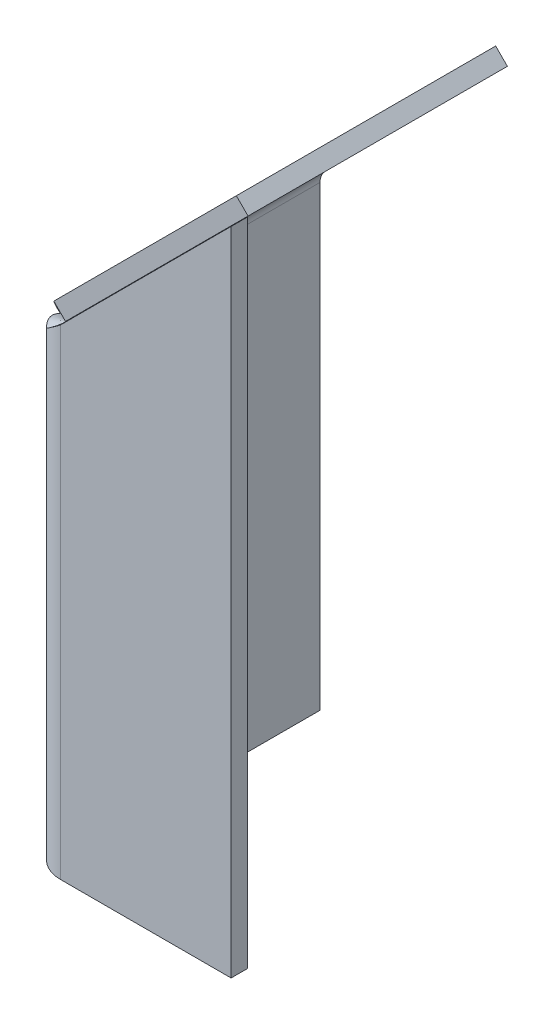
ISO-10303-21;
HEADER;
FILE_DESCRIPTION(('STEP AP214'),'2;1');
FILE_NAME('part.step','',(''),(''),'','','');
FILE_SCHEMA(('AUTOMOTIVE_DESIGN { 1 0 10303 214 1 1 1 1 }'));
ENDSEC;
DATA;
#1=APPLICATION_CONTEXT('core data for automotive mechanical design processes');
#2=APPLICATION_PROTOCOL_DEFINITION('international standard','automotive_design',2000,#1);
#3=PRODUCT_CONTEXT('',#1,'mechanical');
#4=PRODUCT('Part','Part','',(#3));
#5=PRODUCT_RELATED_PRODUCT_CATEGORY('part','',(#4));
#6=PRODUCT_DEFINITION_FORMATION('','',#4);
#7=PRODUCT_DEFINITION_CONTEXT('part definition',#1,'design');
#8=PRODUCT_DEFINITION('design','',#6,#7);
#9=PRODUCT_DEFINITION_SHAPE('','',#8);
#10=(LENGTH_UNIT() NAMED_UNIT(*) SI_UNIT(.MILLI.,.METRE.));
#11=(NAMED_UNIT(*) PLANE_ANGLE_UNIT() SI_UNIT($,.RADIAN.));
#12=(NAMED_UNIT(*) SI_UNIT($,.STERADIAN.) SOLID_ANGLE_UNIT());
#13=UNCERTAINTY_MEASURE_WITH_UNIT(LENGTH_MEASURE(1.E-05),#10,'distance_accuracy_value','');
#14=(GEOMETRIC_REPRESENTATION_CONTEXT(3) GLOBAL_UNCERTAINTY_ASSIGNED_CONTEXT((#13)) GLOBAL_UNIT_ASSIGNED_CONTEXT((#10,
#11,#12)) REPRESENTATION_CONTEXT('',''));
#15=CARTESIAN_POINT('',(0.,0.,0.));
#16=DIRECTION('',(0.,0.,1.));
#17=DIRECTION('',(1.,0.,0.));
#18=AXIS2_PLACEMENT_3D('',#15,#16,#17);
#19=CARTESIAN_POINT('',(0.,0.,49.9999999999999));
#20=DIRECTION('',(-1.,0.,0.));
#21=DIRECTION('',(0.,0.,1.));
#22=AXIS2_PLACEMENT_3D('',#19,#20,#21);
#23=PLANE('',#22);
#24=DIRECTION('',(0.,0.,-1.));
#25=VECTOR('',#24,1.);
#26=CARTESIAN_POINT('',(0.,0.,49.9999999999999));
#27=LINE('',#26,#25);
#28=CARTESIAN_POINT('',(0.,0.,44.));
#29=VERTEX_POINT('',#28);
#30=CARTESIAN_POINT('',(0.,0.,0.));
#31=VERTEX_POINT('',#30);
#32=EDGE_CURVE('E446',#29,#31,#27,.T.);
#33=ORIENTED_EDGE('',*,*,#32,.F.);
#34=DIRECTION('',(0.,1.,0.));
#35=VECTOR('',#34,1.);
#36=CARTESIAN_POINT('',(0.,0.,44.));
#37=LINE('',#36,#35);
#38=CARTESIAN_POINT('',(0.,82.7270054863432,43.9999999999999));
#39=VERTEX_POINT('',#38);
#40=EDGE_CURVE('E448',#29,#39,#37,.T.);
#41=ORIENTED_EDGE('',*,*,#40,.T.);
#42=DIRECTION('',(0.,0.,-1.));
#43=VECTOR('',#42,1.);
#44=CARTESIAN_POINT('',(0.,82.7270054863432,49.9999999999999));
#45=LINE('',#44,#43);
#46=CARTESIAN_POINT('',(0.,82.7270054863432,0.));
#47=VERTEX_POINT('',#46);
#48=EDGE_CURVE('E458',#39,#47,#45,.T.);
#49=ORIENTED_EDGE('',*,*,#48,.T.);
#50=DIRECTION('',(0.,1.,0.));
#51=VECTOR('',#50,1.);
#52=CARTESIAN_POINT('',(0.,0.,0.));
#53=LINE('',#52,#51);
#54=EDGE_CURVE('E437',#31,#47,#53,.T.);
#55=ORIENTED_EDGE('',*,*,#54,.F.);
#56=EDGE_LOOP('',(#33,#41,#49,#55));
#57=FACE_BOUND('',#56,.T.);
#58=ADVANCED_FACE('F76',(#57),#23,.T.);
#59=CARTESIAN_POINT('',(3.00000000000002,0.,49.9999999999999));
#60=DIRECTION('',(0.,-1.,0.));
#61=DIRECTION('',(0.,0.,-1.));
#62=AXIS2_PLACEMENT_3D('',#59,#60,#61);
#63=PLANE('',#62);
#64=DIRECTION('',(0.,0.,-1.));
#65=VECTOR('',#64,1.);
#66=CARTESIAN_POINT('',(3.00000000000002,0.,49.9999999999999));
#67=LINE('',#66,#65);
#68=CARTESIAN_POINT('',(3.00000000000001,0.,44.));
#69=VERTEX_POINT('',#68);
#70=CARTESIAN_POINT('',(3.00000000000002,0.,0.));
#71=VERTEX_POINT('',#70);
#72=EDGE_CURVE('E101',#69,#71,#67,.T.);
#73=ORIENTED_EDGE('',*,*,#72,.F.);
#74=DIRECTION('',(-1.,0.,0.));
#75=VECTOR('',#74,1.);
#76=CARTESIAN_POINT('',(3.,0.,43.9999999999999));
#77=LINE('',#76,#75);
#78=EDGE_CURVE('E449',#69,#29,#77,.T.);
#79=ORIENTED_EDGE('',*,*,#78,.T.);
#80=ORIENTED_EDGE('',*,*,#32,.T.);
#81=DIRECTION('',(-1.,0.,0.));
#82=VECTOR('',#81,1.);
#83=CARTESIAN_POINT('',(3.00000000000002,0.,0.));
#84=LINE('',#83,#82);
#85=EDGE_CURVE('E440',#71,#31,#84,.T.);
#86=ORIENTED_EDGE('',*,*,#85,.F.);
#87=EDGE_LOOP('',(#73,#79,#80,#86));
#88=FACE_BOUND('',#87,.T.);
#89=ADVANCED_FACE('F393',(#88),#63,.T.);
#90=CARTESIAN_POINT('',(3.00000000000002,0.,49.9999999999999));
#91=DIRECTION('',(-1.,0.,0.));
#92=DIRECTION('',(0.,0.,1.));
#93=AXIS2_PLACEMENT_3D('',#90,#91,#92);
#94=PLANE('',#93);
#95=DIRECTION('',(0.,1.,0.));
#96=VECTOR('',#95,1.);
#97=CARTESIAN_POINT('',(3.,0.,43.9999999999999));
#98=LINE('',#97,#96);
#99=CARTESIAN_POINT('',(3.00000000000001,82.7270054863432,43.9999999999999));
#100=VERTEX_POINT('',#99);
#101=EDGE_CURVE('E452',#69,#100,#98,.T.);
#102=ORIENTED_EDGE('',*,*,#101,.F.);
#103=ORIENTED_EDGE('',*,*,#72,.T.);
#104=DIRECTION('',(0.,1.,0.));
#105=VECTOR('',#104,1.);
#106=CARTESIAN_POINT('',(3.00000000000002,0.,0.));
#107=LINE('',#106,#105);
#108=CARTESIAN_POINT('',(3.00000000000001,82.7270054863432,0.));
#109=VERTEX_POINT('',#108);
#110=EDGE_CURVE('E443',#71,#109,#107,.T.);
#111=ORIENTED_EDGE('',*,*,#110,.T.);
#112=DIRECTION('',(0.,0.,-1.));
#113=VECTOR('',#112,1.);
#114=CARTESIAN_POINT('',(3.00000000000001,82.7270054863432,49.9999999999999));
#115=LINE('',#114,#113);
#116=EDGE_CURVE('E85',#100,#109,#115,.T.);
#117=ORIENTED_EDGE('',*,*,#116,.F.);
#118=EDGE_LOOP('',(#102,#103,#111,#117));
#119=FACE_BOUND('',#118,.T.);
#120=ADVANCED_FACE('F398',(#119),#94,.F.);
#121=CARTESIAN_POINT('',(3.87867965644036,84.8483258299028,0.));
#122=DIRECTION('',(0.,0.,-1.));
#123=DIRECTION('',(-1.,0.,0.));
#124=AXIS2_PLACEMENT_3D('',#121,#122,#123);
#125=PLANE('',#124);
#126=ORIENTED_EDGE('',*,*,#54,.T.);
#127=DIRECTION('',(1.,0.,0.));
#128=VECTOR('',#127,1.);
#129=CARTESIAN_POINT('',(0.,82.7270054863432,0.));
#130=LINE('',#129,#128);
#131=EDGE_CURVE('E13',#47,#109,#130,.T.);
#132=ORIENTED_EDGE('',*,*,#131,.T.);
#133=ORIENTED_EDGE('',*,*,#110,.F.);
#134=ORIENTED_EDGE('',*,*,#85,.T.);
#135=EDGE_LOOP('',(#126,#132,#133,#134));
#136=FACE_BOUND('',#135,.T.);
#137=ADVANCED_FACE('F78',(#136),#125,.T.);
#138=CARTESIAN_POINT('',(36.909033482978,82.7270054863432,50.0000000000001));
#139=DIRECTION('',(-1.,0.,0.));
#140=DIRECTION('',(0.,0.,1.));
#141=AXIS2_PLACEMENT_3D('',#138,#139,#140);
#142=PLANE('',#141);
#143=DIRECTION('',(0.,-1.,0.));
#144=VECTOR('',#143,1.);
#145=CARTESIAN_POINT('',(36.909033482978,82.7270054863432,47.0000000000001));
#146=LINE('',#145,#144);
#147=CARTESIAN_POINT('',(36.909033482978,0.,47.0000000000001));
#148=VERTEX_POINT('',#147);
#149=CARTESIAN_POINT('',(36.909033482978,117.778679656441,47.0000000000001));
#150=VERTEX_POINT('',#149);
#151=EDGE_CURVE('E540',#148,#150,#146,.F.);
#152=ORIENTED_EDGE('',*,*,#151,.T.);
#153=DIRECTION('',(0.,0.,-1.));
#154=VECTOR('',#153,1.);
#155=CARTESIAN_POINT('',(36.909033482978,117.778679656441,50.0000000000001));
#156=LINE('',#155,#154);
#157=CARTESIAN_POINT('',(36.909033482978,117.778679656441,50.0000000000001));
#158=VERTEX_POINT('',#157);
#159=EDGE_CURVE('E433',#158,#150,#156,.T.);
#160=ORIENTED_EDGE('',*,*,#159,.F.);
#161=DIRECTION('',(0.,1.,0.));
#162=VECTOR('',#161,1.);
#163=CARTESIAN_POINT('',(36.909033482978,0.,50.0000000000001));
#164=LINE('',#163,#162);
#165=CARTESIAN_POINT('',(36.909033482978,0.,50.0000000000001));
#166=VERTEX_POINT('',#165);
#167=EDGE_CURVE('E533',#166,#158,#164,.T.);
#168=ORIENTED_EDGE('',*,*,#167,.F.);
#169=DIRECTION('',(0.,0.,-1.));
#170=VECTOR('',#169,1.);
#171=CARTESIAN_POINT('',(36.909033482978,0.,50.0000000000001));
#172=LINE('',#171,#170);
#173=EDGE_CURVE('E537',#166,#148,#172,.T.);
#174=ORIENTED_EDGE('',*,*,#173,.T.);
#175=EDGE_LOOP('',(#152,#160,#168,#174));
#176=FACE_BOUND('',#175,.T.);
#177=ADVANCED_FACE('F721',(#176),#142,.F.);
#178=CARTESIAN_POINT('',(2.99999999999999,0.,50.));
#179=DIRECTION('',(0.,0.,-1.));
#180=DIRECTION('',(-1.,0.,0.));
#181=AXIS2_PLACEMENT_3D('',#178,#179,#180);
#182=PLANE('',#181);
#183=DIRECTION('',(0.,1.,0.));
#184=VECTOR('',#183,1.);
#185=CARTESIAN_POINT('',(5.99999999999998,82.7270054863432,50.));
#186=LINE('',#185,#184);
#187=CARTESIAN_POINT('',(5.99999999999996,0.,50.));
#188=VERTEX_POINT('',#187);
#189=CARTESIAN_POINT('',(5.99999999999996,86.8696461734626,50.));
#190=VERTEX_POINT('',#189);
#191=EDGE_CURVE('E420',#188,#190,#186,.T.);
#192=ORIENTED_EDGE('',*,*,#191,.F.);
#193=DIRECTION('',(1.,0.,0.));
#194=VECTOR('',#193,1.);
#195=CARTESIAN_POINT('',(2.99999999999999,0.,50.));
#196=LINE('',#195,#194);
#197=EDGE_CURVE('E535',#188,#166,#196,.T.);
#198=ORIENTED_EDGE('',*,*,#197,.T.);
#199=ORIENTED_EDGE('',*,*,#167,.T.);
#200=DIRECTION('',(0.707106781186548,0.707106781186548,0.));
#201=VECTOR('',#200,1.);
#202=CARTESIAN_POINT('',(5.99999999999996,86.8696461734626,50.));
#203=LINE('',#202,#201);
#204=EDGE_CURVE('E430',#190,#158,#203,.T.);
#205=ORIENTED_EDGE('',*,*,#204,.F.);
#206=EDGE_LOOP('',(#192,#198,#199,#205));
#207=FACE_BOUND('',#206,.T.);
#208=ADVANCED_FACE('F555',(#207),#182,.F.);
#209=CARTESIAN_POINT('',(36.909033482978,0.,50.0000000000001));
#210=DIRECTION('',(0.,1.,0.));
#211=DIRECTION('',(-1.,0.,0.));
#212=AXIS2_PLACEMENT_3D('',#209,#210,#211);
#213=PLANE('',#212);
#214=DIRECTION('',(0.,0.,1.));
#215=VECTOR('',#214,1.);
#216=CARTESIAN_POINT('',(5.99999999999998,0.,47.));
#217=LINE('',#216,#215);
#218=CARTESIAN_POINT('',(5.99999999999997,0.,47.));
#219=VERTEX_POINT('',#218);
#220=EDGE_CURVE('E542',#219,#188,#217,.T.);
#221=ORIENTED_EDGE('',*,*,#220,.F.);
#222=DIRECTION('',(-1.,0.,0.));
#223=VECTOR('',#222,1.);
#224=CARTESIAN_POINT('',(36.909033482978,0.,47.0000000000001));
#225=LINE('',#224,#223);
#226=EDGE_CURVE('E531',#219,#148,#225,.F.);
#227=ORIENTED_EDGE('',*,*,#226,.T.);
#228=ORIENTED_EDGE('',*,*,#173,.F.);
#229=ORIENTED_EDGE('',*,*,#197,.F.);
#230=EDGE_LOOP('',(#221,#227,#228,#229));
#231=FACE_BOUND('',#230,.T.);
#232=ADVANCED_FACE('F560',(#231),#213,.F.);
#233=CARTESIAN_POINT('',(3.,0.,47.));
#234=DIRECTION('',(0.,0.,-1.));
#235=DIRECTION('',(-1.,0.,0.));
#236=AXIS2_PLACEMENT_3D('',#233,#234,#235);
#237=PLANE('',#236);
#238=ORIENTED_EDGE('',*,*,#226,.F.);
#239=DIRECTION('',(0.,-1.,0.));
#240=VECTOR('',#239,1.);
#241=CARTESIAN_POINT('',(5.99999999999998,82.7270054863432,47.));
#242=LINE('',#241,#240);
#243=CARTESIAN_POINT('',(5.99999999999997,86.8696461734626,47.));
#244=VERTEX_POINT('',#243);
#245=EDGE_CURVE('E545',#244,#219,#242,.T.);
#246=ORIENTED_EDGE('',*,*,#245,.F.);
#247=DIRECTION('',(0.707106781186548,0.707106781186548,0.));
#248=VECTOR('',#247,1.);
#249=CARTESIAN_POINT('',(5.99999999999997,86.8696461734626,47.));
#250=LINE('',#249,#248);
#251=EDGE_CURVE('E434',#244,#150,#250,.T.);
#252=ORIENTED_EDGE('',*,*,#251,.T.);
#253=ORIENTED_EDGE('',*,*,#151,.F.);
#254=EDGE_LOOP('',(#238,#246,#252,#253));
#255=FACE_BOUND('',#254,.T.);
#256=ADVANCED_FACE('F410',(#255),#237,.T.);
#257=CARTESIAN_POINT('',(5.99999999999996,86.8696461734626,50.));
#258=DIRECTION('',(-0.707106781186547,0.707106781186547,0.));
#259=DIRECTION('',(-0.707106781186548,-0.707106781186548,0.));
#260=AXIS2_PLACEMENT_3D('',#257,#258,#259);
#261=PLANE('',#260);
#262=ORIENTED_EDGE('',*,*,#251,.F.);
#263=CARTESIAN_POINT('',(5.99999999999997,86.8696461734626,50.));
#264=CARTESIAN_POINT('',(5.99999999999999,86.8696461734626,47.));
#265=B_SPLINE_CURVE_WITH_KNOTS('',1,(#263,#264),.UNSPECIFIED.,.F.,.F.,(2,2),(0.,1.),.UNSPECIFIED.);
#266=EDGE_CURVE('E427',#190,#244,#265,.T.);
#267=ORIENTED_EDGE('',*,*,#266,.F.);
#268=ORIENTED_EDGE('',*,*,#204,.T.);
#269=ORIENTED_EDGE('',*,*,#159,.T.);
#270=EDGE_LOOP('',(#262,#267,#268,#269));
#271=FACE_BOUND('',#270,.T.);
#272=ADVANCED_FACE('F405',(#271),#261,.T.);
#273=CARTESIAN_POINT('',(5.99999999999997,86.8696461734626,50.));
#274=CARTESIAN_POINT('',(5.2594519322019,86.3142351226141,50.));
#275=CARTESIAN_POINT('',(4.51926940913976,85.758925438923,49.8613776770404));
#276=CARTESIAN_POINT('',(3.13865769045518,84.6482047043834,49.3255076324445));
#277=CARTESIAN_POINT('',(2.49877551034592,84.0928950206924,48.9284722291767));
#278=CARTESIAN_POINT('',(1.95214403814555,83.5374839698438,48.4288669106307));
#279=CARTESIAN_POINT('',(5.99999999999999,86.8696461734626,47.));
#280=CARTESIAN_POINT('',(5.62974351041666,86.3142614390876,47.));
#281=CARTESIAN_POINT('',(5.25963470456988,85.758925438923,46.9306888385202));
#282=CARTESIAN_POINT('',(4.56932884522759,84.6482047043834,46.6627538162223));
#283=CARTESIAN_POINT('',(4.24937480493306,84.0928687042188,46.4642242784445));
#284=CARTESIAN_POINT('',(3.97607201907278,83.5374839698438,46.2144334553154));
#285=B_SPLINE_SURFACE_WITH_KNOTS('',1,3,((#273,#274,#275,#276,#277,#278),(#279,#280,#281,#282,
#283,#284)),.UNSPECIFIED.,.F.,.F.,.F.,(2,2),(4,2,4),(0.,1.),(0.,0.5,1.),.UNSPECIFIED.);
#286=CARTESIAN_POINT('',(5.99999999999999,86.8696461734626,47.));
#287=CARTESIAN_POINT('',(5.62974351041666,86.3142614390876,47.));
#288=CARTESIAN_POINT('',(5.25963470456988,85.758925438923,46.9306888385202));
#289=CARTESIAN_POINT('',(4.56932884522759,84.6482047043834,46.6627538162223));
#290=CARTESIAN_POINT('',(4.24937480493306,84.0928687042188,46.4642242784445));
#291=CARTESIAN_POINT('',(3.97607201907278,83.5374839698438,46.2144334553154));
#292=B_SPLINE_CURVE_WITH_KNOTS('',3,(#286,#287,#288,#289,#290,#291),.UNSPECIFIED.,.F.,.F.,(4,2,
4),(0.,0.5,1.),.UNSPECIFIED.);
#293=CARTESIAN_POINT('',(3.97607201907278,83.5374839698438,46.2144334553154));
#294=VERTEX_POINT('',#293);
#295=EDGE_CURVE('E334',#244,#294,#292,.T.);
#296=CARTESIAN_POINT('',(3.97607201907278,83.5374839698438,46.2144334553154));
#297=CARTESIAN_POINT('',(1.95214403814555,83.5374839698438,48.4288669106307));
#298=B_SPLINE_CURVE_WITH_KNOTS('',1,(#296,#297),.UNSPECIFIED.,.F.,.F.,(2,2),(0.,1.),.UNSPECIFIED.);
#299=CARTESIAN_POINT('',(1.95214403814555,83.5374839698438,48.4288669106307));
#300=VERTEX_POINT('',#299);
#301=EDGE_CURVE('E306',#294,#300,#298,.T.);
#302=CARTESIAN_POINT('',(1.95214403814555,83.5374839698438,48.4288669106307));
#303=CARTESIAN_POINT('',(2.49877551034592,84.0928950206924,48.9284722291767));
#304=CARTESIAN_POINT('',(3.13865769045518,84.6482047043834,49.3255076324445));
#305=CARTESIAN_POINT('',(4.51926940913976,85.758925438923,49.8613776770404));
#306=CARTESIAN_POINT('',(5.2594519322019,86.3142351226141,50.));
#307=CARTESIAN_POINT('',(5.99999999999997,86.8696461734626,50.));
#308=B_SPLINE_CURVE_WITH_KNOTS('',3,(#302,#303,#304,#305,#306,#307),.UNSPECIFIED.,.F.,.F.,(4,2,
4),(0.,0.5,1.),.UNSPECIFIED.);
#309=EDGE_CURVE('E311',#190,#300,#308,.F.);
#310=ORIENTED_EDGE('',*,*,#266,.T.);
#311=ORIENTED_EDGE('',*,*,#295,.T.);
#312=ORIENTED_EDGE('',*,*,#301,.T.);
#313=ORIENTED_EDGE('',*,*,#309,.F.);
#314=EDGE_LOOP('',(#310,#311,#312,#313));
#315=FACE_BOUND('',#314,.T.);
#316=ADVANCED_FACE('F409',(#315),#285,.T.);
#317=CARTESIAN_POINT('',(1.93190475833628,83.5374839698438,48.4510112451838));
#318=CARTESIAN_POINT('',(1.57111586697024,83.6089387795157,48.1212606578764));
#319=CARTESIAN_POINT('',(1.27348277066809,83.6463969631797,47.7688932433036));
#320=CARTESIAN_POINT('',(0.909380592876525,83.6517773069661,47.2391973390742));
#321=CARTESIAN_POINT('',(0.801688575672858,83.6450924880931,47.0623786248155));
#322=CARTESIAN_POINT('',(0.658566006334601,83.6223478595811,46.799983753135));
#323=CARTESIAN_POINT('',(0.613924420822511,83.6126467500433,46.7129841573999));
#324=CARTESIAN_POINT('',(0.551275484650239,83.594915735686,46.5835246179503));
#325=CARTESIAN_POINT('',(0.531111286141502,83.5884755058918,46.5405443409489));
#326=CARTESIAN_POINT('',(0.501906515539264,83.5780203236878,46.476372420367));
#327=CARTESIAN_POINT('',(0.492345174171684,83.5744027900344,46.455031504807));
#328=CARTESIAN_POINT('',(0.473563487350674,83.5669027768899,46.4124553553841));
#329=CARTESIAN_POINT('',(0.463371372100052,83.5625893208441,46.3889466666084));
#330=CARTESIAN_POINT('',(0.32599132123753,83.5016617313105,46.067546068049));
#331=CARTESIAN_POINT('',(0.205850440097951,83.4036566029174,45.7185842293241));
#332=CARTESIAN_POINT('',(0.0277799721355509,83.126323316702,44.9264387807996));
#333=CARTESIAN_POINT('',(-0.0300000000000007,82.9471256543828,44.4832295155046));
#334=CARTESIAN_POINT('',(-0.0299999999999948,82.7270054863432,43.9999999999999));
#335=CARTESIAN_POINT('',(1.95214403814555,83.5374839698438,48.4288669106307));
#336=CARTESIAN_POINT('',(1.59315017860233,83.6089387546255,48.1007569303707));
#337=CARTESIAN_POINT('',(1.29699778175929,83.6463969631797,47.7501425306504));
#338=CARTESIAN_POINT('',(0.934707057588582,83.6517773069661,47.2230819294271));
#339=CARTESIAN_POINT('',(0.827550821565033,83.6450924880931,47.0471429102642));
#340=CARTESIAN_POINT('',(0.685140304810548,83.6223478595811,46.7860534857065));
#341=CARTESIAN_POINT('',(0.640720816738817,83.6126467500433,46.699486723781));
#342=CARTESIAN_POINT('',(0.578383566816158,83.594915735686,46.5706712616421));
#343=CARTESIAN_POINT('',(0.558319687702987,83.5884755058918,46.5279048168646));
#344=CARTESIAN_POINT('',(0.529260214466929,83.5780203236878,46.4640521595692));
#345=CARTESIAN_POINT('',(0.519746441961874,83.5744027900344,46.4428174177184));
#346=CARTESIAN_POINT('',(0.50105819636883,83.5669027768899,46.4004530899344));
#347=CARTESIAN_POINT('',(0.490916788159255,83.5625893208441,46.3770613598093));
#348=CARTESIAN_POINT('',(0.354220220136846,83.5016617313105,46.057259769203));
#349=CARTESIAN_POINT('',(0.234677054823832,83.4036566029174,45.710034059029));
#350=CARTESIAN_POINT('',(0.0574925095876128,83.126323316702,44.9218296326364));
#351=CARTESIAN_POINT('',(0.,82.9471252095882,44.4808249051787));
#352=CARTESIAN_POINT('',(0.,82.7270054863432,43.9999999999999));
#353=CARTESIAN_POINT('',(3.97607201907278,83.5374839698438,46.2144334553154));
#354=CARTESIAN_POINT('',(3.79658134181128,83.6089362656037,46.0503841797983));
#355=CARTESIAN_POINT('',(3.64849889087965,83.6463969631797,45.8750712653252));
#356=CARTESIAN_POINT('',(3.46735352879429,83.6517773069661,45.6115409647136));
#357=CARTESIAN_POINT('',(3.41377541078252,83.6450924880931,45.5235714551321));
#358=CARTESIAN_POINT('',(3.34257015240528,83.6223478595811,45.3930267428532));
#359=CARTESIAN_POINT('',(3.32036040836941,83.6126467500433,45.3497433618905));
#360=CARTESIAN_POINT('',(3.28919178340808,83.594915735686,45.2853356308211));
#361=CARTESIAN_POINT('',(3.2791598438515,83.5884755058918,45.2639524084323));
#362=CARTESIAN_POINT('',(3.26463010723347,83.5780203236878,45.2320260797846));
#363=CARTESIAN_POINT('',(3.25987322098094,83.5744027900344,45.2214087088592));
#364=CARTESIAN_POINT('',(3.25052909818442,83.5669027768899,45.2002265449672));
#365=CARTESIAN_POINT('',(3.24545839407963,83.5625893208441,45.1885306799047));
#366=CARTESIAN_POINT('',(3.17711011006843,83.5016617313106,45.0286298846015));
#367=CARTESIAN_POINT('',(3.11733852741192,83.4036566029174,44.8550170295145));
#368=CARTESIAN_POINT('',(3.02874625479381,83.126323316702,44.4609148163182));
#369=CARTESIAN_POINT('',(3.,82.9470807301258,44.2403638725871));
#370=CARTESIAN_POINT('',(3.00000000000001,82.7270054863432,44.));
#371=CARTESIAN_POINT('',(3.99651369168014,83.5374839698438,46.1920676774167));
#372=CARTESIAN_POINT('',(3.81883599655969,83.6089362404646,46.0296754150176));
#373=CARTESIAN_POINT('',(3.67224905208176,83.6463969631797,45.8561330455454));
#374=CARTESIAN_POINT('',(3.49293325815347,83.6517773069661,45.59526440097));
#375=CARTESIAN_POINT('',(3.43989627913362,83.6450924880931,45.5081833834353));
#376=CARTESIAN_POINT('',(3.36941019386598,83.6223478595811,45.3789571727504));
#377=CARTESIAN_POINT('',(3.34742476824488,83.6126467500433,45.3361109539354));
#378=CARTESIAN_POINT('',(3.31657094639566,83.594915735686,45.2723537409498));
#379=CARTESIAN_POINT('',(3.3066403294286,83.5884755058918,45.2511864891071));
#380=CARTESIAN_POINT('',(3.29225734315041,83.5780203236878,45.2195826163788));
#381=CARTESIAN_POINT('',(3.28754850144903,83.5744027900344,45.2090724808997));
#382=CARTESIAN_POINT('',(3.27829875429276,83.5669027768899,45.188104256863));
#383=CARTESIAN_POINT('',(3.27327926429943,83.5625893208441,45.1765265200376));
#384=CARTESIAN_POINT('',(3.20562129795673,83.5016617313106,45.018240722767));
#385=CARTESIAN_POINT('',(3.14645340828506,83.4036566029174,44.8463813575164));
#386=CARTESIAN_POINT('',(3.05875591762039,83.126323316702,44.4562595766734));
#387=CARTESIAN_POINT('',(3.0303,82.9470802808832,44.237935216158));
#388=CARTESIAN_POINT('',(3.03030000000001,82.7270054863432,44.));
#389=B_SPLINE_SURFACE_WITH_KNOTS('',1,3,((#317,#318,#319,#320,#321,#322,#323,#324,#325,#326,
#327,#328,#329,#330,#331,#332,#333,#334),(#335,#336,#337,#338,#339,#340,#341,#342,#343,#344,
#345,#346,#347,#348,#349,#350,#351,#352),(#353,#354,#355,#356,#357,#358,#359,#360,#361,#362,
#363,#364,#365,#366,#367,#368,#369,#370),(#371,#372,#373,#374,#375,#376,#377,#378,#379,#380,
#381,#382,#383,#384,#385,#386,#387,#388)),.UNSPECIFIED.,.F.,.F.,.F.,(2,1,1,2),(4,2,2,2,2,2,2,2,
4),(-0.01,0.,1.,1.0101),(0.,0.25,0.375,0.4375,0.46875,0.484375,0.5,0.75,1.),.UNSPECIFIED.);
#390=CARTESIAN_POINT('',(3.97607201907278,83.5374839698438,46.2144334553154));
#391=CARTESIAN_POINT('',(3.93119210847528,83.5553399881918,46.1734269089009));
#392=CARTESIAN_POINT('',(3.88717129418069,83.5715306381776,46.1306775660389));
#393=CARTESIAN_POINT('',(3.80109702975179,83.5999573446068,46.0417282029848));
#394=CARTESIAN_POINT('',(3.75905042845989,83.6121803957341,45.9955174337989));
#395=CARTESIAN_POINT('',(3.67704022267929,83.6320274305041,45.8994449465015));
#396=CARTESIAN_POINT('',(3.63710324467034,83.6396015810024,45.8495498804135));
#397=CARTESIAN_POINT('',(3.56031471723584,83.6491504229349,45.7470048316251));
#398=CARTESIAN_POINT('',(3.52345862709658,83.6511335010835,45.6943590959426));
#399=CARTESIAN_POINT('',(3.46501946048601,83.6491117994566,45.6048990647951));
#400=CARTESIAN_POINT('',(3.44245168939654,83.6468882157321,45.5686802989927));
#401=CARTESIAN_POINT('',(3.39900437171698,83.6393894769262,45.4955364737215));
#402=CARTESIAN_POINT('',(3.3781249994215,83.6341140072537,45.4586113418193));
#403=CARTESIAN_POINT('',(3.33834462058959,83.6203852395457,45.3846802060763));
#404=CARTESIAN_POINT('',(3.31942906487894,83.6119578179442,45.3476772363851));
#405=CARTESIAN_POINT('',(3.28348072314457,83.5918101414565,45.2736615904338));
#406=CARTESIAN_POINT('',(3.26644717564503,83.5800912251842,45.2366489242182));
#407=CARTESIAN_POINT('',(3.24238569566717,83.5600464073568,45.1815092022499));
#408=CARTESIAN_POINT('',(3.23462973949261,83.5529731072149,45.1632347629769));
#409=CARTESIAN_POINT('',(3.21959718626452,83.5379927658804,45.1268309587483));
#410=CARTESIAN_POINT('',(3.21232059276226,83.5300857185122,45.1087015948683));
#411=CARTESIAN_POINT('',(3.19117500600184,83.5053107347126,45.0545170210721));
#412=CARTESIAN_POINT('',(3.17799321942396,83.4873915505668,45.018672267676));
#413=CARTESIAN_POINT('',(3.15320618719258,83.4491994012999,44.9472117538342));
#414=CARTESIAN_POINT('',(3.14161810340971,83.4289046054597,44.9116019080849));
#415=CARTESIAN_POINT('',(3.12003566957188,83.3865742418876,44.8409341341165));
#416=CARTESIAN_POINT('',(3.11004169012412,83.3645382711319,44.8058763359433));
#417=CARTESIAN_POINT('',(3.08858241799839,83.3118296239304,44.7251919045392));
#418=CARTESIAN_POINT('',(3.07766302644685,83.280642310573,44.6797571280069));
#419=CARTESIAN_POINT('',(3.05816356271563,83.2163974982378,44.5896798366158));
#420=CARTESIAN_POINT('',(3.04958512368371,83.1833387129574,44.5450378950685));
#421=CARTESIAN_POINT('',(3.03459493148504,83.115695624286,44.4564981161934));
#422=CARTESIAN_POINT('',(3.02818499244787,83.0811100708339,44.4126009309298));
#423=CARTESIAN_POINT('',(3.01757276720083,83.0118747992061,44.3269945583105));
#424=CARTESIAN_POINT('',(3.01330444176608,82.9772650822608,44.2852610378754));
#425=CARTESIAN_POINT('',(3.00655506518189,82.9071236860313,44.202509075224));
#426=CARTESIAN_POINT('',(3.00407211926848,82.871593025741,44.1614899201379));
#427=CARTESIAN_POINT('',(3.00079814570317,82.7998190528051,44.0802113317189));
#428=CARTESIAN_POINT('',(3.00000247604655,82.7635779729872,44.0399501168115));
#429=CARTESIAN_POINT('',(3.00000000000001,82.7270054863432,44.));
#430=B_SPLINE_CURVE_WITH_KNOTS('',3,(#390,#391,#392,#393,#394,#395,#396,#397,#398,#399,#400,
#401,#402,#403,#404,#405,#406,#407,#408,#409,#410,#411,#412,#413,#414,#415,#416,#417,#418,#419,
#420,#421,#422,#423,#424,#425,#426,#427,#428,#429),.UNSPECIFIED.,.F.,.F.,(4,2,2,2,2,2,2,2,2,2,2,
2,2,2,2,2,2,2,2,4),(0.,0.190106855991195,0.380830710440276,0.573564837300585,0.76600970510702,
0.894075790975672,1.02215508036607,1.14920517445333,1.27620367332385,1.33940827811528,
1.40261335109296,1.52904741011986,1.65675118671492,1.78448460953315,1.95291945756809,
2.1214715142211,2.29016423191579,2.45327428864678,2.6162109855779,2.77869882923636),.UNSPECIFIED.);
#431=EDGE_CURVE('E312',#294,#100,#430,.T.);
#432=CARTESIAN_POINT('',(3.03030000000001,82.7270054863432,44.));
#433=CARTESIAN_POINT('',(3.00000000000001,82.7270054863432,44.));
#434=CARTESIAN_POINT('',(0.,82.7270054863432,43.9999999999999));
#435=CARTESIAN_POINT('',(-0.0299999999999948,82.7270054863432,43.9999999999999));
#436=B_SPLINE_CURVE_WITH_KNOTS('',1,(#432,#433,#434,#435),.UNSPECIFIED.,.F.,.F.,(2,1,1,2),
(-0.01,9.9999999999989E-05,1.0001,1.0101),.UNSPECIFIED.);
#437=EDGE_CURVE('E294',#100,#39,#436,.T.);
#438=CARTESIAN_POINT('',(1.95214403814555,83.5374839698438,48.4288669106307));
#439=CARTESIAN_POINT('',(1.8806924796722,83.5517026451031,48.3635668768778));
#440=CARTESIAN_POINT('',(1.81069696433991,83.5647870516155,48.2964151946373));
#441=CARTESIAN_POINT('',(1.67378432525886,83.5884572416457,48.1585207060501));
#442=CARTESIAN_POINT('',(1.60686962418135,83.5990410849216,48.0877751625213));
#443=CARTESIAN_POINT('',(1.47638351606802,83.6174591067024,47.9428926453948));
#444=CARTESIAN_POINT('',(1.41281275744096,83.625292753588,47.8687550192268));
#445=CARTESIAN_POINT('',(1.28981679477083,83.6378809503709,47.7180034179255));
#446=CARTESIAN_POINT('',(1.23035881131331,83.6426631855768,47.6414185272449));
#447=CARTESIAN_POINT('',(1.11517345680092,83.6489741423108,47.485379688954));
#448=CARTESIAN_POINT('',(1.05944543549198,83.6505034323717,47.4059262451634));
#449=CARTESIAN_POINT('',(0.951905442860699,83.6499750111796,47.2444037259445));
#450=CARTESIAN_POINT('',(0.900093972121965,83.647916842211,47.1623343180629));
#451=CARTESIAN_POINT('',(0.801299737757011,83.6399056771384,46.9971064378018));
#452=CARTESIAN_POINT('',(0.754258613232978,83.6340086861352,46.9139802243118));
#453=CARTESIAN_POINT('',(0.664356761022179,83.617979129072,46.7459048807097));
#454=CARTESIAN_POINT('',(0.621495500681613,83.6078471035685,46.6609559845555));
#455=CARTESIAN_POINT('',(0.540116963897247,83.5829734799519,46.4897095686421));
#456=CARTESIAN_POINT('',(0.501597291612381,83.568234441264,46.403412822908));
#457=CARTESIAN_POINT('',(0.428901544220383,83.5334970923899,46.2297442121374));
#458=CARTESIAN_POINT('',(0.394738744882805,83.5134832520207,46.1423699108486));
#459=CARTESIAN_POINT('',(0.330829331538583,83.4692631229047,45.9670320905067));
#460=CARTESIAN_POINT('',(0.301085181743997,83.4450545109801,45.8790682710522));
#461=CARTESIAN_POINT('',(0.245949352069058,83.3932092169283,45.7027723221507));
#462=CARTESIAN_POINT('',(0.220558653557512,83.3655717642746,45.6144401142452));
#463=CARTESIAN_POINT('',(0.174889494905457,83.3085126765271,45.4407828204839));
#464=CARTESIAN_POINT('',(0.154459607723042,83.2791914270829,45.3554642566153));
#465=CARTESIAN_POINT('',(0.11749605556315,83.218346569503,45.1848066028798));
#466=CARTESIAN_POINT('',(0.100961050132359,83.1868237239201,45.0994675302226));
#467=CARTESIAN_POINT('',(0.0717044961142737,83.1218506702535,44.9288716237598));
#468=CARTESIAN_POINT('',(0.0589829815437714,83.0884004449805,44.8436147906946));
#469=CARTESIAN_POINT('',(0.0373305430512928,83.0199712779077,44.6737014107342));
#470=CARTESIAN_POINT('',(0.0283823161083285,82.9850001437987,44.5890439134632));
#471=CARTESIAN_POINT('',(0.0141209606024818,82.9135914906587,44.4200507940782));
#472=CARTESIAN_POINT('',(0.00880759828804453,82.8771540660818,44.3357151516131));
#473=CARTESIAN_POINT('',(0.00174806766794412,82.8029993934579,44.1674991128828));
#474=CARTESIAN_POINT('',(4.25455896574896E-07,82.7652826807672,44.083618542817));
#475=CARTESIAN_POINT('',(0.,82.7270054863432,43.9999999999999));
#476=B_SPLINE_CURVE_WITH_KNOTS('',3,(#438,#439,#440,#441,#442,#443,#444,#445,#446,#447,#448,
#449,#450,#451,#452,#453,#454,#455,#456,#457,#458,#459,#460,#461,#462,#463,#464,#465,#466,#467,
#468,#469,#470,#471,#472,#473,#474,#475),.UNSPECIFIED.,.F.,.F.,(4,2,2,2,2,2,2,2,2,2,2,2,2,2,2,2,
2,2,4),(0.,0.293480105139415,0.587187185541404,0.880951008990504,1.17201013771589,
1.46301839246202,1.75406377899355,2.04095544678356,2.32781050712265,2.61450648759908,
2.90205618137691,3.18976563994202,3.47753986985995,3.75492855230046,4.03222162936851,
4.30951717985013,4.58552694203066,4.86151895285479,5.13739685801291),.UNSPECIFIED.);
#477=EDGE_CURVE('E307',#300,#39,#476,.T.);
#478=ORIENTED_EDGE('',*,*,#301,.F.);
#479=ORIENTED_EDGE('',*,*,#431,.T.);
#480=ORIENTED_EDGE('',*,*,#437,.T.);
#481=ORIENTED_EDGE('',*,*,#477,.F.);
#482=EDGE_LOOP('',(#478,#479,#480,#481));
#483=FACE_BOUND('',#482,.T.);
#484=ADVANCED_FACE('F349',(#483),#389,.T.);
#485=CARTESIAN_POINT('',(6.00000000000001,0.,44.));
#486=DIRECTION('',(0.,-1.,0.));
#487=DIRECTION('',(0.,0.,-1.));
#488=AXIS2_PLACEMENT_3D('',#485,#486,#487);
#489=PLANE('',#488);
#490=CARTESIAN_POINT('',(6.00000000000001,0.,44.));
#491=DIRECTION('',(0.,-1.,0.));
#492=DIRECTION('',(0.,0.,-1.));
#493=AXIS2_PLACEMENT_3D('',#490,#491,#492);
#494=CIRCLE('',#493,3.);
#495=EDGE_CURVE('E308',#69,#219,#494,.F.);
#496=ORIENTED_EDGE('',*,*,#495,.T.);
#497=ORIENTED_EDGE('',*,*,#220,.T.);
#498=CARTESIAN_POINT('',(6.00000000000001,0.,44.));
#499=DIRECTION('',(0.,1.,0.));
#500=DIRECTION('',(0.,0.,1.));
#501=AXIS2_PLACEMENT_3D('',#498,#499,#500);
#502=CIRCLE('',#501,6.);
#503=EDGE_CURVE('E298',#29,#188,#502,.T.);
#504=ORIENTED_EDGE('',*,*,#503,.F.);
#505=ORIENTED_EDGE('',*,*,#78,.F.);
#506=EDGE_LOOP('',(#496,#497,#504,#505));
#507=FACE_BOUND('',#506,.T.);
#508=ADVANCED_FACE('F348',(#507),#489,.T.);
#509=CARTESIAN_POINT('',(6.00000000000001,130.643195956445,44.));
#510=DIRECTION('',(0.,-1.,0.));
#511=DIRECTION('',(0.,0.,-1.));
#512=AXIS2_PLACEMENT_3D('',#509,#510,#511);
#513=CYLINDRICAL_SURFACE('',#512,6.);
#514=ORIENTED_EDGE('',*,*,#40,.F.);
#515=ORIENTED_EDGE('',*,*,#503,.T.);
#516=ORIENTED_EDGE('',*,*,#191,.T.);
#517=ORIENTED_EDGE('',*,*,#309,.T.);
#518=ORIENTED_EDGE('',*,*,#477,.T.);
#519=EDGE_LOOP('',(#514,#515,#516,#517,#518));
#520=FACE_BOUND('',#519,.T.);
#521=ADVANCED_FACE('F269',(#520),#513,.T.);
#522=CARTESIAN_POINT('',(6.00000000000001,130.643195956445,44.));
#523=DIRECTION('',(0.,-1.,0.));
#524=DIRECTION('',(0.,0.,-1.));
#525=AXIS2_PLACEMENT_3D('',#522,#523,#524);
#526=CYLINDRICAL_SURFACE('',#525,3.);
#527=ORIENTED_EDGE('',*,*,#101,.T.);
#528=ORIENTED_EDGE('',*,*,#431,.F.);
#529=ORIENTED_EDGE('',*,*,#295,.F.);
#530=ORIENTED_EDGE('',*,*,#245,.T.);
#531=ORIENTED_EDGE('',*,*,#495,.F.);
#532=EDGE_LOOP('',(#527,#528,#529,#530,#531));
#533=FACE_BOUND('',#532,.T.);
#534=ADVANCED_FACE('F339',(#533),#526,.F.);
#535=CARTESIAN_POINT('',(6.00000000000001,82.7270054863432,0.));
#536=DIRECTION('',(0.,0.,-1.));
#537=DIRECTION('',(-1.,0.,0.));
#538=AXIS2_PLACEMENT_3D('',#535,#536,#537);
#539=PLANE('',#538);
#540=DIRECTION('',(-0.707106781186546,0.707106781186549,0.));
#541=VECTOR('',#540,1.);
#542=CARTESIAN_POINT('',(3.8786796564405,84.8483258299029,0.));
#543=LINE('',#542,#541);
#544=CARTESIAN_POINT('',(3.8786796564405,84.8483258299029,0.));
#545=VERTEX_POINT('',#544);
#546=CARTESIAN_POINT('',(1.75735931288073,86.9696461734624,0.));
#547=VERTEX_POINT('',#546);
#548=EDGE_CURVE('E568',#545,#547,#543,.T.);
#549=ORIENTED_EDGE('',*,*,#548,.F.);
#550=CARTESIAN_POINT('',(6.00000000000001,82.7270054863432,0.));
#551=DIRECTION('',(0.,0.,-1.));
#552=DIRECTION('',(0.,1.,0.));
#553=AXIS2_PLACEMENT_3D('',#550,#551,#552);
#554=CIRCLE('',#553,3.);
#555=EDGE_CURVE('E93',#545,#109,#554,.F.);
#556=ORIENTED_EDGE('',*,*,#555,.T.);
#557=ORIENTED_EDGE('',*,*,#131,.F.);
#558=CARTESIAN_POINT('',(6.00000000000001,82.7270054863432,0.));
#559=DIRECTION('',(0.,0.,1.));
#560=DIRECTION('',(1.,0.,0.));
#561=AXIS2_PLACEMENT_3D('',#558,#559,#560);
#562=CIRCLE('',#561,6.);
#563=EDGE_CURVE('E207',#547,#47,#562,.T.);
#564=ORIENTED_EDGE('',*,*,#563,.F.);
#565=EDGE_LOOP('',(#549,#556,#557,#564));
#566=FACE_BOUND('',#565,.T.);
#567=ADVANCED_FACE('F232',(#566),#539,.T.);
#568=CARTESIAN_POINT('',(0.,82.7270054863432,44.));
#569=CARTESIAN_POINT('',(0.,83.4834251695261,44.4218808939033));
#570=CARTESIAN_POINT('',(0.145017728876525,84.2554140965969,44.8770994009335));
#571=CARTESIAN_POINT('',(0.735680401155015,85.7109273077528,45.853529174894));
#572=CARTESIAN_POINT('',(1.18137496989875,86.3936618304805,46.3745871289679));
#573=CARTESIAN_POINT('',(1.75735931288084,86.9696461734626,46.9292893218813));
#574=CARTESIAN_POINT('',(3.00000000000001,82.7270054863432,44.));
#575=CARTESIAN_POINT('',(3.00000000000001,83.1052577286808,44.4219281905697));
#576=CARTESIAN_POINT('',(3.07250886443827,83.49120979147,44.8770994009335));
#577=CARTESIAN_POINT('',(3.36784020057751,84.218966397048,45.853529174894));
#578=CARTESIAN_POINT('',(3.59075504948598,84.5604012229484,46.3747172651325));
#579=CARTESIAN_POINT('',(3.87867965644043,84.8483258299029,46.9292893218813));
#580=B_SPLINE_SURFACE_WITH_KNOTS('',1,3,((#568,#569,#570,#571,#572,#573),(#574,#575,#576,#577,
#578,#579)),.UNSPECIFIED.,.F.,.F.,.F.,(2,2),(4,2,4),(0.,1.),(0.,0.5,1.),.UNSPECIFIED.);
#581=CARTESIAN_POINT('',(3.00000000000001,82.7270054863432,44.));
#582=CARTESIAN_POINT('',(3.00000000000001,83.1052577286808,44.4219281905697));
#583=CARTESIAN_POINT('',(3.07250886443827,83.49120979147,44.8770994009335));
#584=CARTESIAN_POINT('',(3.36784020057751,84.218966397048,45.853529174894));
#585=CARTESIAN_POINT('',(3.59075504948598,84.5604012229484,46.3747172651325));
#586=CARTESIAN_POINT('',(3.87867965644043,84.8483258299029,46.9292893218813));
#587=B_SPLINE_CURVE_WITH_KNOTS('',3,(#581,#582,#583,#584,#585,#586),.UNSPECIFIED.,.F.,.F.,(4,2,
4),(0.,0.5,1.),.UNSPECIFIED.);
#588=CARTESIAN_POINT('',(3.8786796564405,84.8483258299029,46.9292893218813));
#589=VERTEX_POINT('',#588);
#590=EDGE_CURVE('E211',#100,#589,#587,.T.);
#591=CARTESIAN_POINT('',(3.87867965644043,84.8483258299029,46.9292893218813));
#592=CARTESIAN_POINT('',(1.75735931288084,86.9696461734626,46.9292893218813));
#593=B_SPLINE_CURVE_WITH_KNOTS('',1,(#591,#592),.UNSPECIFIED.,.F.,.F.,(2,2),(0.,1.),.UNSPECIFIED.);
#594=CARTESIAN_POINT('',(1.75735931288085,86.9696461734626,46.9292893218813));
#595=VERTEX_POINT('',#594);
#596=EDGE_CURVE('E200',#595,#589,#593,.F.);
#597=CARTESIAN_POINT('',(1.75735931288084,86.9696461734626,46.9292893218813));
#598=CARTESIAN_POINT('',(1.18137496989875,86.3936618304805,46.3745871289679));
#599=CARTESIAN_POINT('',(0.735680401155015,85.7109273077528,45.853529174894));
#600=CARTESIAN_POINT('',(0.145017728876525,84.2554140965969,44.8770994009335));
#601=CARTESIAN_POINT('',(0.,83.4834251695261,44.4218808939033));
#602=CARTESIAN_POINT('',(0.,82.7270054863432,44.));
#603=B_SPLINE_CURVE_WITH_KNOTS('',3,(#597,#598,#599,#600,#601,#602),.UNSPECIFIED.,.F.,.F.,(4,2,
4),(0.,0.5,1.),.UNSPECIFIED.);
#604=EDGE_CURVE('E210',#39,#595,#603,.F.);
#605=ORIENTED_EDGE('',*,*,#590,.T.);
#606=ORIENTED_EDGE('',*,*,#596,.F.);
#607=ORIENTED_EDGE('',*,*,#604,.F.);
#608=ORIENTED_EDGE('',*,*,#437,.F.);
#609=EDGE_LOOP('',(#605,#606,#607,#608));
#610=FACE_BOUND('',#609,.T.);
#611=ADVANCED_FACE('F230',(#610),#580,.T.);
#612=CARTESIAN_POINT('',(6.00000000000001,82.7270054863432,69.1577078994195));
#613=DIRECTION('',(0.,0.,-1.));
#614=DIRECTION('',(0.,1.,0.));
#615=AXIS2_PLACEMENT_3D('',#612,#613,#614);
#616=CYLINDRICAL_SURFACE('',#615,6.);
#617=ORIENTED_EDGE('',*,*,#48,.F.);
#618=ORIENTED_EDGE('',*,*,#604,.T.);
#619=DIRECTION('',(0.,0.,-1.));
#620=VECTOR('',#619,1.);
#621=CARTESIAN_POINT('',(1.75735931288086,86.9696461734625,49.9999999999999));
#622=LINE('',#621,#620);
#623=EDGE_CURVE('E187',#595,#547,#622,.T.);
#624=ORIENTED_EDGE('',*,*,#623,.T.);
#625=ORIENTED_EDGE('',*,*,#563,.T.);
#626=EDGE_LOOP('',(#617,#618,#624,#625));
#627=FACE_BOUND('',#626,.T.);
#628=ADVANCED_FACE('F219',(#627),#616,.T.);
#629=CARTESIAN_POINT('',(6.00000000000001,82.7270054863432,69.1577078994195));
#630=DIRECTION('',(0.,0.,-1.));
#631=DIRECTION('',(0.,1.,0.));
#632=AXIS2_PLACEMENT_3D('',#629,#630,#631);
#633=CYLINDRICAL_SURFACE('',#632,3.);
#634=ORIENTED_EDGE('',*,*,#116,.T.);
#635=ORIENTED_EDGE('',*,*,#555,.F.);
#636=DIRECTION('',(0.,0.,-1.));
#637=VECTOR('',#636,1.);
#638=CARTESIAN_POINT('',(3.8786796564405,84.8483258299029,49.9999999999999));
#639=LINE('',#638,#637);
#640=EDGE_CURVE('E374',#589,#545,#639,.T.);
#641=ORIENTED_EDGE('',*,*,#640,.F.);
#642=ORIENTED_EDGE('',*,*,#590,.F.);
#643=EDGE_LOOP('',(#634,#635,#641,#642));
#644=FACE_BOUND('',#643,.T.);
#645=ADVANCED_FACE('F229',(#644),#633,.F.);
#646=CARTESIAN_POINT('',(34.7877131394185,120.,49.9999999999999));
#647=DIRECTION('',(0.707106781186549,0.707106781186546,0.));
#648=DIRECTION('',(-0.707106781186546,0.707106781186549,0.));
#649=AXIS2_PLACEMENT_3D('',#646,#647,#648);
#650=PLANE('',#649);
#651=DIRECTION('',(0.707106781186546,-0.707106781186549,0.));
#652=VECTOR('',#651,1.);
#653=CARTESIAN_POINT('',(34.7877131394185,120.,46.9292893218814));
#654=LINE('',#653,#652);
#655=CARTESIAN_POINT('',(34.7877131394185,120.,46.9292893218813));
#656=VERTEX_POINT('',#655);
#657=CARTESIAN_POINT('',(36.9090334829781,117.87867965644,46.9292893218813));
#658=VERTEX_POINT('',#657);
#659=EDGE_CURVE('E176',#656,#658,#654,.T.);
#660=ORIENTED_EDGE('',*,*,#659,.T.);
#661=DIRECTION('',(0.,0.,-1.));
#662=VECTOR('',#661,1.);
#663=CARTESIAN_POINT('',(36.9090334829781,117.87867965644,49.9999999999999));
#664=LINE('',#663,#662);
#665=CARTESIAN_POINT('',(36.9090334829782,117.87867965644,0.));
#666=VERTEX_POINT('',#665);
#667=EDGE_CURVE('E186',#658,#666,#664,.T.);
#668=ORIENTED_EDGE('',*,*,#667,.T.);
#669=DIRECTION('',(0.707106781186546,-0.707106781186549,0.));
#670=VECTOR('',#669,1.);
#671=CARTESIAN_POINT('',(34.7877131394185,120.,0.));
#672=LINE('',#671,#670);
#673=CARTESIAN_POINT('',(34.7877131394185,120.,0.));
#674=VERTEX_POINT('',#673);
#675=EDGE_CURVE('E198',#674,#666,#672,.T.);
#676=ORIENTED_EDGE('',*,*,#675,.F.);
#677=DIRECTION('',(0.,0.,-1.));
#678=VECTOR('',#677,1.);
#679=CARTESIAN_POINT('',(34.7877131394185,120.,49.9999999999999));
#680=LINE('',#679,#678);
#681=EDGE_CURVE('E192',#656,#674,#680,.T.);
#682=ORIENTED_EDGE('',*,*,#681,.F.);
#683=EDGE_LOOP('',(#660,#668,#676,#682));
#684=FACE_BOUND('',#683,.T.);
#685=ADVANCED_FACE('F196',(#684),#650,.T.);
#686=CARTESIAN_POINT('',(1.52655665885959E-13,85.2122868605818,49.9999999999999));
#687=DIRECTION('',(-0.707106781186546,0.707106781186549,0.));
#688=DIRECTION('',(-0.707106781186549,-0.707106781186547,0.));
#689=AXIS2_PLACEMENT_3D('',#686,#687,#688);
#690=PLANE('',#689);
#691=DIRECTION('',(0.707106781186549,0.707106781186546,0.));
#692=VECTOR('',#691,1.);
#693=CARTESIAN_POINT('',(-46.6265664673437,38.5857203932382,46.9292893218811));
#694=LINE('',#693,#692);
#695=EDGE_CURVE('E180',#595,#656,#694,.T.);
#696=ORIENTED_EDGE('',*,*,#695,.T.);
#697=ORIENTED_EDGE('',*,*,#681,.T.);
#698=DIRECTION('',(0.707106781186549,0.707106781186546,0.));
#699=VECTOR('',#698,1.);
#700=CARTESIAN_POINT('',(1.45716771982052E-13,85.2122868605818,0.));
#701=LINE('',#700,#699);
#702=EDGE_CURVE('E569',#547,#674,#701,.T.);
#703=ORIENTED_EDGE('',*,*,#702,.F.);
#704=ORIENTED_EDGE('',*,*,#623,.F.);
#705=EDGE_LOOP('',(#696,#697,#703,#704));
#706=FACE_BOUND('',#705,.T.);
#707=ADVANCED_FACE('F190',(#706),#690,.T.);
#708=CARTESIAN_POINT('',(-46.6265664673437,38.5857203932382,46.9292893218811));
#709=DIRECTION('',(0.,0.,-1.));
#710=DIRECTION('',(-0.707106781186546,0.707106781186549,0.));
#711=AXIS2_PLACEMENT_3D('',#708,#709,#710);
#712=PLANE('',#711);
#713=ORIENTED_EDGE('',*,*,#695,.F.);
#714=ORIENTED_EDGE('',*,*,#596,.T.);
#715=DIRECTION('',(-0.707106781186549,-0.707106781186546,0.));
#716=VECTOR('',#715,1.);
#717=CARTESIAN_POINT('',(2.12132034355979,83.0909665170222,46.9292893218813));
#718=LINE('',#717,#716);
#719=EDGE_CURVE('E182',#658,#589,#718,.T.);
#720=ORIENTED_EDGE('',*,*,#719,.F.);
#721=ORIENTED_EDGE('',*,*,#659,.F.);
#722=EDGE_LOOP('',(#713,#714,#720,#721));
#723=FACE_BOUND('',#722,.T.);
#724=ADVANCED_FACE('F178',(#723),#712,.F.);
#725=CARTESIAN_POINT('',(2.12132034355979,83.0909665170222,49.9999999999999));
#726=DIRECTION('',(-0.707106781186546,0.707106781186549,0.));
#727=DIRECTION('',(-0.707106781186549,-0.707106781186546,0.));
#728=AXIS2_PLACEMENT_3D('',#725,#726,#727);
#729=PLANE('',#728);
#730=ORIENTED_EDGE('',*,*,#667,.F.);
#731=ORIENTED_EDGE('',*,*,#719,.T.);
#732=ORIENTED_EDGE('',*,*,#640,.T.);
#733=DIRECTION('',(0.707106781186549,0.707106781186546,0.));
#734=VECTOR('',#733,1.);
#735=CARTESIAN_POINT('',(2.1213203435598,83.0909665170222,0.));
#736=LINE('',#735,#734);
#737=EDGE_CURVE('E204',#545,#666,#736,.T.);
#738=ORIENTED_EDGE('',*,*,#737,.T.);
#739=EDGE_LOOP('',(#730,#731,#732,#738));
#740=FACE_BOUND('',#739,.T.);
#741=ADVANCED_FACE('F384',(#740),#729,.F.);
#742=CARTESIAN_POINT('',(6.00000000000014,82.7270054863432,0.));
#743=DIRECTION('',(0.,0.,1.));
#744=DIRECTION('',(1.,0.,0.));
#745=AXIS2_PLACEMENT_3D('',#742,#743,#744);
#746=PLANE('',#745);
#747=ORIENTED_EDGE('',*,*,#737,.F.);
#748=ORIENTED_EDGE('',*,*,#548,.T.);
#749=ORIENTED_EDGE('',*,*,#702,.T.);
#750=ORIENTED_EDGE('',*,*,#675,.T.);
#751=EDGE_LOOP('',(#747,#748,#749,#750));
#752=FACE_BOUND('',#751,.T.);
#753=ADVANCED_FACE('F233',(#752),#746,.F.);
#754=CLOSED_SHELL('',(#58,#89,#120,#137,#177,#208,#232,#256,#272,#316,#484,#508,#521,#534,#567,
#611,#628,#645,#685,#707,#724,#741,#753));
#755=MANIFOLD_SOLID_BREP('B2',#754);
#756=ADVANCED_BREP_SHAPE_REPRESENTATION('',(#18,#755),#14);
#757=SHAPE_DEFINITION_REPRESENTATION(#9,#756);
ENDSEC;
END-ISO-10303-21;
